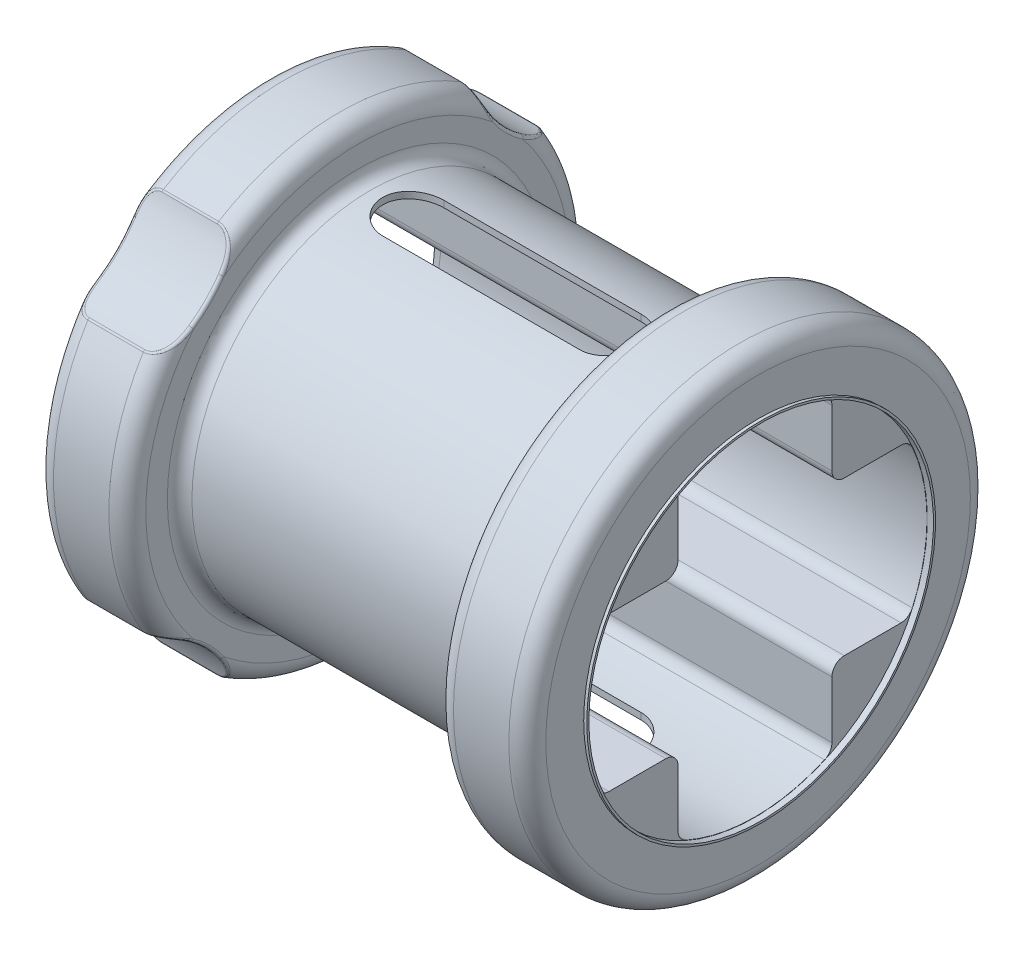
from build123d import *

# Parameters (mm, degrees)
FILLET1_R               = 0.2
CUT_EXTRUDE1_DEPTH      = 10.59817691
FILLET2_R               = 0.2
FILLET3_R               = 0.3
SKETCH3_R               = 2.8
CUT_EXTRUDE2_DEPTH      = 0.05
BOSS_EXTRUDE1_START     = 0.05
SKETCH4_R               = 2.833646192
SKETCH4_R_2             = 2.8
BOSS_EXTRUDE1_DEPTH     = 0.05
CUT_EXTRUDE3_DEPTH      = 7.672892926
CUT_EXTRUDE3_DEPTH_BACK = 7.672892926
CUT_EXTRUDE4_START      = -2
CUT_EXTRUDE4_DEPTH      = 2
FILLET4_R               = 0.05


with BuildPart() as part:
    # Sketch1 → Revolve1 (revolve)
    with BuildSketch(Plane.XY, mode=Mode.PRIVATE) as revolve1_sk:
        Polygon((4, 0), (-4, 0), (-4, 3.75), (-2.5, 3.75), (-2.5, 2.9), (2.5, 2.9), (2.5, 3.75), (4, 3.75), align=None)
    revolve(revolve1_sk.sketch.rotate(Axis((4, 0, 0), (-1, 0, 0)), 90), axis=Axis((4, 0, 0), (-1, 0, 0)))

    # Fillet1
    fillet1_edges = [part.edges().sort_by_distance(p)[0] for p in [
        (-2.5, 0, 2.9),
        (2.5, 0, 2.9),
    ]]
    fillet(fillet1_edges, radius=FILLET1_R)

    # Sketch2 → Cut-Extrude1 (cut, through all)
    with BuildSketch(Plane.ZY.offset(4)):
        with BuildLine():
            Line((-1.25, 2.5), (-1.25, 1.25))
            Line((-1.25, 1.25), (-2.5, 1.25))
            ThreePointArc((-2.5, 1.25), (-2.795084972, 0), (-2.5, -1.25))
            Line((-2.5, -1.25), (-1.25, -1.25))
            Line((-1.25, -1.25), (-1.25, -2.5))
            ThreePointArc((-1.25, -2.5), (0, -2.795084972), (1.25, -2.5))
            Line((1.25, -2.5), (1.25, -1.25))
            Line((1.25, -1.25), (2.5, -1.25))
            ThreePointArc((2.5, -1.25), (2.795084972, 0), (2.5, 1.25))
            Line((2.5, 1.25), (1.25, 1.25))
            Line((1.25, 1.25), (1.25, 2.5))
            ThreePointArc((1.25, 2.5), (0, 2.795084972), (-1.25, 2.5))
        make_face()
    extrude(amount=-CUT_EXTRUDE1_DEPTH, mode=Mode.SUBTRACT)

    # Fillet2
    fillet2_edges = [part.edges().sort_by_distance(p)[0] for p in [
        (0, 2.5, -1.25),
        (0, 2.5, 1.25),
        (0, 1.25, 1.25),
        (0, 1.25, 2.5),
        (0, -1.25, 2.5),
        (0, -1.25, 1.25),
        (0, -2.5, 1.25),
        (0, -2.5, -1.25),
        (0, -1.25, -1.25),
        (0, -1.25, -2.5),
        (0, 1.25, -2.5),
        (0, 1.25, -1.25),
    ]]
    fillet(fillet2_edges, radius=FILLET2_R)

    # Fillet3
    fillet3_edges = [part.edges().sort_by_distance(p)[0] for p in [
        (2.5, 0, 3.75),
        (4, 0, 3.75),
        (-4, 0, 3.75),
        (-2.5, 0, 3.75),
    ]]
    fillet(fillet3_edges, radius=FILLET3_R)

    # Sketch3 → Cut-Extrude2 (cut)
    with BuildSketch(Plane.ZY.offset(4)):
        Circle(SKETCH3_R)
    cut_extrude2 = extrude(amount=-CUT_EXTRUDE2_DEPTH, mode=Mode.SUBTRACT)

    # Sketch4 → Boss-Extrude1 (add)
    with BuildSketch(Plane.ZY.offset(4).offset(BOSS_EXTRUDE1_START)):
        Circle(SKETCH4_R)
        Circle(SKETCH4_R_2, mode=Mode.SUBTRACT)
    boss_extrude1 = extrude(amount=-BOSS_EXTRUDE1_DEPTH)

    # Sketch5 → Cut-Extrude3 (cut, two sides: drawn at the far end of the back side and taken through both)
    with BuildSketch(Plane(origin=(0, 0, 0), x_dir=(1, 0, 0), z_dir=(0, 1, 0)).offset(-CUT_EXTRUDE3_DEPTH_BACK)):
        with BuildLine():
            Line((-1.6, 0.5), (1.6, 0.5))
            ThreePointArc((1.6, 0.5), (2.1, 0), (1.6, -0.5))
            Line((1.6, -0.5), (-1.6, -0.5))
            ThreePointArc((-1.6, -0.5), (-2.1, 0), (-1.6, 0.5))
        make_face()
    extrude(amount=CUT_EXTRUDE3_DEPTH + CUT_EXTRUDE3_DEPTH_BACK, mode=Mode.SUBTRACT)

    # Mirror2: Cut-Extrude2, Boss-Extrude1 across plane
    add(cut_extrude2.mirror(Plane(origin=(0, 0, 0), x_dir=(0, 0, 1), z_dir=(1, 0, 0))), mode=Mode.SUBTRACT)
    add(boss_extrude1.mirror(Plane(origin=(0, 0, 0), x_dir=(0, 0, 1), z_dir=(1, 0, 0))))

    # Sketch6 → Cut-Extrude4 (cut)
    with BuildSketch(Plane.ZY.offset(4).offset(CUT_EXTRUDE4_START)):
        with BuildLine():
            ThreePointArc((1.980514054, 3.184346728), (2.438318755, 2.440717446), (3.182397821, 1.98364415))
            ThreePointArc((3.182397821, 1.98364415), (2.650346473, 2.652953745), (1.980514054, 3.184346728))
        make_face()
        with BuildLine():
            ThreePointArc((-3.184346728, 1.980514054), (-2.440717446, 2.438318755), (-1.98364415, 3.182397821))
            ThreePointArc((-1.98364415, 3.182397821), (-2.652953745, 2.650346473), (-3.184346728, 1.980514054))
        make_face()
        with BuildLine():
            ThreePointArc((3.184346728, -1.980514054), (2.440717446, -2.438318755), (1.98364415, -3.182397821))
            ThreePointArc((1.98364415, -3.182397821), (2.652953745, -2.650346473), (3.184346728, -1.980514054))
        make_face()
        with BuildLine():
            ThreePointArc((-1.980514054, -3.184346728), (-2.438318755, -2.440717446), (-3.182397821, -1.98364415))
            ThreePointArc((-3.182397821, -1.98364415), (-2.650346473, -2.652953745), (-1.980514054, -3.184346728))
        make_face()
    extrude(amount=CUT_EXTRUDE4_DEPTH, mode=Mode.SUBTRACT)

    # Fillet4
    fillet4_edges = [part.edges().sort_by_distance(p)[0] for p in [
        (-3.981475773, 2.841610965, -2.134159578),
        (-3.981475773, 2.131364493, -2.843708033),
        (-3.981475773, 2.134159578, 2.841610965),
        (-3.981475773, 2.843708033, 2.131364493),
        (-3.981475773, -2.841610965, 2.134159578),
        (-3.981475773, -2.131364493, 2.843708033),
        (-3.981475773, -2.134159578, -2.841610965),
        (-3.981475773, -2.843708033, -2.131364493),
        (-3.25, -3.184346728, -1.980514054),
        (-2.518524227, -2.134159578, -2.841610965),
        (-2.518524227, -2.843708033, -2.131364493),
        (-3.25, -1.98364415, -3.182397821),
        (-3.25, -1.980514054, 3.184346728),
        (-2.518524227, -2.841610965, 2.134159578),
        (-2.518524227, -2.131364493, 2.843708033),
        (-3.25, -3.182397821, 1.98364415),
        (-3.25, 3.184346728, 1.980514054),
        (-2.518524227, 2.134159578, 2.841610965),
        (-2.518524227, 2.843708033, 2.131364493),
        (-3.25, 1.98364415, 3.182397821),
        (-3.25, 1.980514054, -3.184346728),
        (-2.518524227, 2.841610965, -2.134159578),
        (-2.518524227, 2.131364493, -2.843708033),
        (-3.25, 3.182397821, -1.98364415),
    ]]
    fillet(fillet4_edges, radius=FILLET4_R)


solid = part.part
